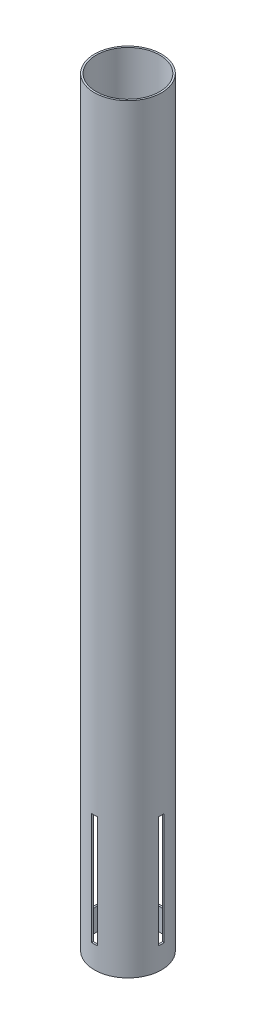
ISO-10303-21;
HEADER;
FILE_DESCRIPTION(('STEP AP214'),'2;1');
FILE_NAME('part.step','',(''),(''),'','','');
FILE_SCHEMA(('AUTOMOTIVE_DESIGN { 1 0 10303 214 1 1 1 1 }'));
ENDSEC;
DATA;
#1=APPLICATION_CONTEXT('core data for automotive mechanical design processes');
#2=APPLICATION_PROTOCOL_DEFINITION('international standard','automotive_design',2000,#1);
#3=PRODUCT_CONTEXT('',#1,'mechanical');
#4=PRODUCT('Part','Part','',(#3));
#5=PRODUCT_RELATED_PRODUCT_CATEGORY('part','',(#4));
#6=PRODUCT_DEFINITION_FORMATION('','',#4);
#7=PRODUCT_DEFINITION_CONTEXT('part definition',#1,'design');
#8=PRODUCT_DEFINITION('design','',#6,#7);
#9=PRODUCT_DEFINITION_SHAPE('','',#8);
#10=(LENGTH_UNIT() NAMED_UNIT(*) SI_UNIT(.MILLI.,.METRE.));
#11=(NAMED_UNIT(*) PLANE_ANGLE_UNIT() SI_UNIT($,.RADIAN.));
#12=(NAMED_UNIT(*) SI_UNIT($,.STERADIAN.) SOLID_ANGLE_UNIT());
#13=UNCERTAINTY_MEASURE_WITH_UNIT(LENGTH_MEASURE(1.E-05),#10,'distance_accuracy_value','');
#14=(GEOMETRIC_REPRESENTATION_CONTEXT(3) GLOBAL_UNCERTAINTY_ASSIGNED_CONTEXT((#13)) GLOBAL_UNIT_ASSIGNED_CONTEXT((#10,
#11,#12)) REPRESENTATION_CONTEXT('',''));
#15=CARTESIAN_POINT('',(0.,0.,0.));
#16=DIRECTION('',(0.,0.,1.));
#17=DIRECTION('',(1.,0.,0.));
#18=AXIS2_PLACEMENT_3D('',#15,#16,#17);
#19=CARTESIAN_POINT('',(0.,863.6,0.));
#20=DIRECTION('',(0.,-1.,0.));
#21=DIRECTION('',(0.,0.,-1.));
#22=AXIS2_PLACEMENT_3D('',#19,#20,#21);
#23=CYLINDRICAL_SURFACE('',#22,38.1);
#24=DIRECTION('',(0.,-1.,0.));
#25=VECTOR('',#24,1.);
#26=CARTESIAN_POINT('',(-37.9611314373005,863.6,-3.24999999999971));
#27=LINE('',#26,#25);
#28=CARTESIAN_POINT('',(-37.9611314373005,152.4,-3.24999999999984));
#29=VERTEX_POINT('',#28);
#30=CARTESIAN_POINT('',(-37.9611314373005,25.4,-3.24999999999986));
#31=VERTEX_POINT('',#30);
#32=EDGE_CURVE('E280',#29,#31,#27,.T.);
#33=ORIENTED_EDGE('',*,*,#32,.F.);
#34=CARTESIAN_POINT('',(0.,152.4,0.));
#35=DIRECTION('',(0.,-1.,0.));
#36=DIRECTION('',(0.,0.,-1.));
#37=AXIS2_PLACEMENT_3D('',#34,#35,#36);
#38=CIRCLE('',#37,38.1);
#39=CARTESIAN_POINT('',(-37.9611314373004,152.4,3.25000000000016));
#40=VERTEX_POINT('',#39);
#41=EDGE_CURVE('E287',#40,#29,#38,.T.);
#42=ORIENTED_EDGE('',*,*,#41,.F.);
#43=DIRECTION('',(0.,-1.,0.));
#44=VECTOR('',#43,1.);
#45=CARTESIAN_POINT('',(-37.9611314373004,863.6,3.25000000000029));
#46=LINE('',#45,#44);
#47=CARTESIAN_POINT('',(-37.9611314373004,25.4,3.25000000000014));
#48=VERTEX_POINT('',#47);
#49=EDGE_CURVE('E292',#48,#40,#46,.F.);
#50=ORIENTED_EDGE('',*,*,#49,.F.);
#51=CARTESIAN_POINT('',(0.,25.4,0.));
#52=DIRECTION('',(0.,1.,0.));
#53=DIRECTION('',(0.,0.,1.));
#54=AXIS2_PLACEMENT_3D('',#51,#52,#53);
#55=CIRCLE('',#54,38.1);
#56=EDGE_CURVE('E296',#31,#48,#55,.T.);
#57=ORIENTED_EDGE('',*,*,#56,.F.);
#58=EDGE_LOOP('',(#33,#42,#50,#57));
#59=FACE_BOUND('',#58,.T.);
#60=DIRECTION('',(0.,-1.,0.));
#61=VECTOR('',#60,1.);
#62=CARTESIAN_POINT('',(3.24999999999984,863.6,37.9611314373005));
#63=LINE('',#62,#61);
#64=CARTESIAN_POINT('',(3.24999999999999,25.4,37.9611314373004));
#65=VERTEX_POINT('',#64);
#66=CARTESIAN_POINT('',(3.24999999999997,152.4,37.9611314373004));
#67=VERTEX_POINT('',#66);
#68=EDGE_CURVE('E243',#65,#67,#63,.F.);
#69=ORIENTED_EDGE('',*,*,#68,.F.);
#70=CARTESIAN_POINT('',(0.,25.4,0.));
#71=DIRECTION('',(0.,1.,0.));
#72=DIRECTION('',(0.,0.,1.));
#73=AXIS2_PLACEMENT_3D('',#70,#71,#72);
#74=CIRCLE('',#73,38.1);
#75=CARTESIAN_POINT('',(-3.25,25.4,37.9611314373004));
#76=VERTEX_POINT('',#75);
#77=EDGE_CURVE('E258',#76,#65,#74,.T.);
#78=ORIENTED_EDGE('',*,*,#77,.F.);
#79=DIRECTION('',(0.,-1.,0.));
#80=VECTOR('',#79,1.);
#81=CARTESIAN_POINT('',(-3.25000000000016,863.6,37.9611314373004));
#82=LINE('',#81,#80);
#83=CARTESIAN_POINT('',(-3.25000000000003,152.4,37.9611314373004));
#84=VERTEX_POINT('',#83);
#85=EDGE_CURVE('E250',#84,#76,#82,.T.);
#86=ORIENTED_EDGE('',*,*,#85,.F.);
#87=CARTESIAN_POINT('',(0.,152.4,0.));
#88=DIRECTION('',(0.,-1.,0.));
#89=DIRECTION('',(0.,0.,-1.));
#90=AXIS2_PLACEMENT_3D('',#87,#88,#89);
#91=CIRCLE('',#90,38.1);
#92=EDGE_CURVE('E246',#67,#84,#91,.T.);
#93=ORIENTED_EDGE('',*,*,#92,.F.);
#94=EDGE_LOOP('',(#69,#78,#86,#93));
#95=FACE_BOUND('',#94,.T.);
#96=CARTESIAN_POINT('',(0.,863.6,0.));
#97=DIRECTION('',(0.,1.,0.));
#98=DIRECTION('',(0.,0.,1.));
#99=AXIS2_PLACEMENT_3D('',#96,#97,#98);
#100=CIRCLE('',#99,38.1);
#101=CARTESIAN_POINT('',(0.,863.6,38.1));
#102=VERTEX_POINT('',#101);
#103=EDGE_CURVE('E223',#102,#102,#100,.T.);
#104=ORIENTED_EDGE('',*,*,#103,.F.);
#105=EDGE_LOOP('',(#104));
#106=FACE_BOUND('',#105,.T.);
#107=CARTESIAN_POINT('',(0.,0.,0.));
#108=DIRECTION('',(0.,1.,0.));
#109=DIRECTION('',(0.,0.,1.));
#110=AXIS2_PLACEMENT_3D('',#107,#108,#109);
#111=CIRCLE('',#110,38.1);
#112=CARTESIAN_POINT('',(0.,0.,38.1));
#113=VERTEX_POINT('',#112);
#114=EDGE_CURVE('E224',#113,#113,#111,.T.);
#115=ORIENTED_EDGE('',*,*,#114,.T.);
#116=EDGE_LOOP('',(#115));
#117=FACE_BOUND('',#116,.T.);
#118=DIRECTION('',(0.,-1.,0.));
#119=VECTOR('',#118,1.);
#120=CARTESIAN_POINT('',(3.24999999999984,863.6,-37.9611314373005));
#121=LINE('',#120,#119);
#122=CARTESIAN_POINT('',(3.24999999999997,152.4,-37.9611314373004));
#123=VERTEX_POINT('',#122);
#124=CARTESIAN_POINT('',(3.24999999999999,25.4,-37.9611314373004));
#125=VERTEX_POINT('',#124);
#126=EDGE_CURVE('E236',#123,#125,#121,.T.);
#127=ORIENTED_EDGE('',*,*,#126,.F.);
#128=CARTESIAN_POINT('',(-3.25000000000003,152.4,-37.9611314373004));
#129=VERTEX_POINT('',#128);
#130=EDGE_CURVE('E247',#129,#123,#91,.T.);
#131=ORIENTED_EDGE('',*,*,#130,.F.);
#132=DIRECTION('',(0.,-1.,0.));
#133=VECTOR('',#132,1.);
#134=CARTESIAN_POINT('',(-3.25000000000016,863.6,-37.9611314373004));
#135=LINE('',#134,#133);
#136=CARTESIAN_POINT('',(-3.25,25.4,-37.9611314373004));
#137=VERTEX_POINT('',#136);
#138=EDGE_CURVE('E254',#137,#129,#135,.F.);
#139=ORIENTED_EDGE('',*,*,#138,.F.);
#140=EDGE_CURVE('E257',#125,#137,#74,.T.);
#141=ORIENTED_EDGE('',*,*,#140,.F.);
#142=EDGE_LOOP('',(#127,#131,#139,#141));
#143=FACE_BOUND('',#142,.T.);
#144=DIRECTION('',(0.,-1.,0.));
#145=VECTOR('',#144,1.);
#146=CARTESIAN_POINT('',(37.9611314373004,863.6,-3.24999999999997));
#147=LINE('',#146,#145);
#148=CARTESIAN_POINT('',(37.9611314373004,25.4,-3.25000000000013));
#149=VERTEX_POINT('',#148);
#150=CARTESIAN_POINT('',(37.9611314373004,152.4,-3.2500000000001));
#151=VERTEX_POINT('',#150);
#152=EDGE_CURVE('E283',#149,#151,#147,.F.);
#153=ORIENTED_EDGE('',*,*,#152,.F.);
#154=CARTESIAN_POINT('',(37.9611314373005,25.4,3.24999999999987));
#155=VERTEX_POINT('',#154);
#156=EDGE_CURVE('E295',#155,#149,#55,.T.);
#157=ORIENTED_EDGE('',*,*,#156,.F.);
#158=DIRECTION('',(0.,-1.,0.));
#159=VECTOR('',#158,1.);
#160=CARTESIAN_POINT('',(37.9611314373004,863.6,3.25000000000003));
#161=LINE('',#160,#159);
#162=CARTESIAN_POINT('',(37.9611314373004,152.4,3.24999999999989));
#163=VERTEX_POINT('',#162);
#164=EDGE_CURVE('E173',#163,#155,#161,.T.);
#165=ORIENTED_EDGE('',*,*,#164,.F.);
#166=EDGE_CURVE('E286',#151,#163,#38,.T.);
#167=ORIENTED_EDGE('',*,*,#166,.F.);
#168=EDGE_LOOP('',(#153,#157,#165,#167));
#169=FACE_BOUND('',#168,.T.);
#170=ADVANCED_FACE('F45',(#59,#95,#106,#117,#143,#169),#23,.T.);
#171=CARTESIAN_POINT('',(0.,863.6,0.));
#172=DIRECTION('',(0.,-1.,0.));
#173=DIRECTION('',(0.,0.,-1.));
#174=AXIS2_PLACEMENT_3D('',#171,#172,#173);
#175=CYLINDRICAL_SURFACE('',#174,36.1);
#176=CARTESIAN_POINT('',(0.,863.6,0.));
#177=DIRECTION('',(0.,1.,0.));
#178=DIRECTION('',(0.,0.,1.));
#179=AXIS2_PLACEMENT_3D('',#176,#177,#178);
#180=CIRCLE('',#179,36.1);
#181=CARTESIAN_POINT('',(0.,863.6,36.1));
#182=VERTEX_POINT('',#181);
#183=EDGE_CURVE('E228',#182,#182,#180,.T.);
#184=ORIENTED_EDGE('',*,*,#183,.T.);
#185=EDGE_LOOP('',(#184));
#186=FACE_BOUND('',#185,.T.);
#187=CARTESIAN_POINT('',(0.,0.,0.));
#188=DIRECTION('',(0.,1.,0.));
#189=DIRECTION('',(0.,0.,1.));
#190=AXIS2_PLACEMENT_3D('',#187,#188,#189);
#191=CIRCLE('',#190,36.1);
#192=CARTESIAN_POINT('',(0.,0.,36.1));
#193=VERTEX_POINT('',#192);
#194=EDGE_CURVE('E232',#193,#193,#191,.T.);
#195=ORIENTED_EDGE('',*,*,#194,.F.);
#196=EDGE_LOOP('',(#195));
#197=FACE_BOUND('',#196,.T.);
#198=CARTESIAN_POINT('',(0.,25.4,0.));
#199=DIRECTION('',(0.,1.,0.));
#200=DIRECTION('',(0.,0.,1.));
#201=AXIS2_PLACEMENT_3D('',#198,#199,#200);
#202=CIRCLE('',#201,36.1);
#203=CARTESIAN_POINT('',(-3.25,25.4,35.9534073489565));
#204=VERTEX_POINT('',#203);
#205=CARTESIAN_POINT('',(3.24999999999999,25.4,35.9534073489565));
#206=VERTEX_POINT('',#205);
#207=EDGE_CURVE('E219',#204,#206,#202,.T.);
#208=ORIENTED_EDGE('',*,*,#207,.T.);
#209=DIRECTION('',(0.,-1.,0.));
#210=VECTOR('',#209,1.);
#211=CARTESIAN_POINT('',(3.24999999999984,863.6,35.9534073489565));
#212=LINE('',#211,#210);
#213=CARTESIAN_POINT('',(3.24999999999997,152.4,35.9534073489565));
#214=VERTEX_POINT('',#213);
#215=EDGE_CURVE('E207',#206,#214,#212,.F.);
#216=ORIENTED_EDGE('',*,*,#215,.T.);
#217=CARTESIAN_POINT('',(0.,152.4,0.));
#218=DIRECTION('',(0.,-1.,0.));
#219=DIRECTION('',(0.,0.,-1.));
#220=AXIS2_PLACEMENT_3D('',#217,#218,#219);
#221=CIRCLE('',#220,36.1);
#222=CARTESIAN_POINT('',(-3.25000000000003,152.4,35.9534073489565));
#223=VERTEX_POINT('',#222);
#224=EDGE_CURVE('E211',#214,#223,#221,.T.);
#225=ORIENTED_EDGE('',*,*,#224,.T.);
#226=DIRECTION('',(0.,-1.,0.));
#227=VECTOR('',#226,1.);
#228=CARTESIAN_POINT('',(-3.25000000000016,863.6,35.9534073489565));
#229=LINE('',#228,#227);
#230=EDGE_CURVE('E215',#223,#204,#229,.T.);
#231=ORIENTED_EDGE('',*,*,#230,.T.);
#232=EDGE_LOOP('',(#208,#216,#225,#231));
#233=FACE_BOUND('',#232,.T.);
#234=CARTESIAN_POINT('',(-3.25000000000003,152.4,-35.9534073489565));
#235=VERTEX_POINT('',#234);
#236=CARTESIAN_POINT('',(3.24999999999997,152.4,-35.9534073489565));
#237=VERTEX_POINT('',#236);
#238=EDGE_CURVE('E201',#235,#237,#221,.T.);
#239=ORIENTED_EDGE('',*,*,#238,.T.);
#240=DIRECTION('',(0.,-1.,0.));
#241=VECTOR('',#240,1.);
#242=CARTESIAN_POINT('',(3.24999999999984,863.6,-35.9534073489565));
#243=LINE('',#242,#241);
#244=CARTESIAN_POINT('',(3.24999999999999,25.4,-35.9534073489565));
#245=VERTEX_POINT('',#244);
#246=EDGE_CURVE('E197',#237,#245,#243,.T.);
#247=ORIENTED_EDGE('',*,*,#246,.T.);
#248=CARTESIAN_POINT('',(-3.25,25.4,-35.9534073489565));
#249=VERTEX_POINT('',#248);
#250=EDGE_CURVE('E206',#245,#249,#202,.T.);
#251=ORIENTED_EDGE('',*,*,#250,.T.);
#252=DIRECTION('',(0.,-1.,0.));
#253=VECTOR('',#252,1.);
#254=CARTESIAN_POINT('',(-3.25000000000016,863.6,-35.9534073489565));
#255=LINE('',#254,#253);
#256=EDGE_CURVE('E202',#249,#235,#255,.F.);
#257=ORIENTED_EDGE('',*,*,#256,.T.);
#258=EDGE_LOOP('',(#239,#247,#251,#257));
#259=FACE_BOUND('',#258,.T.);
#260=CARTESIAN_POINT('',(0.,152.4,0.));
#261=DIRECTION('',(0.,-1.,0.));
#262=DIRECTION('',(0.,0.,-1.));
#263=AXIS2_PLACEMENT_3D('',#260,#261,#262);
#264=CIRCLE('',#263,36.1);
#265=CARTESIAN_POINT('',(-35.9534073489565,152.4,3.25000000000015));
#266=VERTEX_POINT('',#265);
#267=CARTESIAN_POINT('',(-35.9534073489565,152.4,-3.24999999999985));
#268=VERTEX_POINT('',#267);
#269=EDGE_CURVE('E184',#266,#268,#264,.T.);
#270=ORIENTED_EDGE('',*,*,#269,.T.);
#271=DIRECTION('',(0.,-1.,0.));
#272=VECTOR('',#271,1.);
#273=CARTESIAN_POINT('',(-35.9534073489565,863.6,-3.24999999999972));
#274=LINE('',#273,#272);
#275=CARTESIAN_POINT('',(-35.9534073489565,25.4,-3.24999999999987));
#276=VERTEX_POINT('',#275);
#277=EDGE_CURVE('E165',#268,#276,#274,.T.);
#278=ORIENTED_EDGE('',*,*,#277,.T.);
#279=CARTESIAN_POINT('',(0.,25.4,0.));
#280=DIRECTION('',(0.,1.,0.));
#281=DIRECTION('',(0.,0.,1.));
#282=AXIS2_PLACEMENT_3D('',#279,#280,#281);
#283=CIRCLE('',#282,36.1);
#284=CARTESIAN_POINT('',(-35.9534073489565,25.4,3.25000000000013));
#285=VERTEX_POINT('',#284);
#286=EDGE_CURVE('E167',#276,#285,#283,.T.);
#287=ORIENTED_EDGE('',*,*,#286,.T.);
#288=DIRECTION('',(0.,-1.,0.));
#289=VECTOR('',#288,1.);
#290=CARTESIAN_POINT('',(-35.9534073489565,863.6,3.25000000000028));
#291=LINE('',#290,#289);
#292=EDGE_CURVE('E191',#285,#266,#291,.F.);
#293=ORIENTED_EDGE('',*,*,#292,.T.);
#294=EDGE_LOOP('',(#270,#278,#287,#293));
#295=FACE_BOUND('',#294,.T.);
#296=CARTESIAN_POINT('',(35.9534073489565,25.4,3.24999999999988));
#297=VERTEX_POINT('',#296);
#298=CARTESIAN_POINT('',(35.9534073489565,25.4,-3.25000000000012));
#299=VERTEX_POINT('',#298);
#300=EDGE_CURVE('E156',#297,#299,#283,.T.);
#301=ORIENTED_EDGE('',*,*,#300,.T.);
#302=DIRECTION('',(0.,-1.,0.));
#303=VECTOR('',#302,1.);
#304=CARTESIAN_POINT('',(35.9534073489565,863.6,-3.24999999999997));
#305=LINE('',#304,#303);
#306=CARTESIAN_POINT('',(35.9534073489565,152.4,-3.2500000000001));
#307=VERTEX_POINT('',#306);
#308=EDGE_CURVE('E11',#299,#307,#305,.F.);
#309=ORIENTED_EDGE('',*,*,#308,.T.);
#310=CARTESIAN_POINT('',(35.9534073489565,152.4,3.2499999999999));
#311=VERTEX_POINT('',#310);
#312=EDGE_CURVE('E53',#307,#311,#264,.T.);
#313=ORIENTED_EDGE('',*,*,#312,.T.);
#314=DIRECTION('',(0.,-1.,0.));
#315=VECTOR('',#314,1.);
#316=CARTESIAN_POINT('',(35.9534073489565,863.6,3.25000000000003));
#317=LINE('',#316,#315);
#318=EDGE_CURVE('E164',#311,#297,#317,.T.);
#319=ORIENTED_EDGE('',*,*,#318,.T.);
#320=EDGE_LOOP('',(#301,#309,#313,#319));
#321=FACE_BOUND('',#320,.T.);
#322=ADVANCED_FACE('F180',(#186,#197,#233,#259,#295,#321),#175,.F.);
#323=CARTESIAN_POINT('',(0.,863.6,0.));
#324=DIRECTION('',(0.,1.,0.));
#325=DIRECTION('',(0.,0.,1.));
#326=AXIS2_PLACEMENT_3D('',#323,#324,#325);
#327=PLANE('',#326);
#328=ORIENTED_EDGE('',*,*,#183,.F.);
#329=EDGE_LOOP('',(#328));
#330=FACE_BOUND('',#329,.T.);
#331=ORIENTED_EDGE('',*,*,#103,.T.);
#332=EDGE_LOOP('',(#331));
#333=FACE_BOUND('',#332,.T.);
#334=ADVANCED_FACE('F371',(#330,#333),#327,.T.);
#335=CARTESIAN_POINT('',(0.,0.,0.));
#336=DIRECTION('',(0.,1.,0.));
#337=DIRECTION('',(0.,0.,1.));
#338=AXIS2_PLACEMENT_3D('',#335,#336,#337);
#339=PLANE('',#338);
#340=ORIENTED_EDGE('',*,*,#194,.T.);
#341=EDGE_LOOP('',(#340));
#342=FACE_BOUND('',#341,.T.);
#343=ORIENTED_EDGE('',*,*,#114,.F.);
#344=EDGE_LOOP('',(#343));
#345=FACE_BOUND('',#344,.T.);
#346=ADVANCED_FACE('F365',(#342,#345),#339,.F.);
#347=CARTESIAN_POINT('',(-3.25,25.4,863.6));
#348=DIRECTION('',(0.,1.,0.));
#349=DIRECTION('',(0.,0.,1.));
#350=AXIS2_PLACEMENT_3D('',#347,#348,#349);
#351=PLANE('',#350);
#352=ORIENTED_EDGE('',*,*,#77,.T.);
#353=DIRECTION('',(0.,0.,-1.));
#354=VECTOR('',#353,1.);
#355=CARTESIAN_POINT('',(3.25,25.4,863.6));
#356=LINE('',#355,#354);
#357=EDGE_CURVE('E276',#65,#206,#356,.T.);
#358=ORIENTED_EDGE('',*,*,#357,.T.);
#359=ORIENTED_EDGE('',*,*,#207,.F.);
#360=DIRECTION('',(0.,0.,-1.));
#361=VECTOR('',#360,1.);
#362=CARTESIAN_POINT('',(-3.25,25.4,863.6));
#363=LINE('',#362,#361);
#364=EDGE_CURVE('E271',#76,#204,#363,.T.);
#365=ORIENTED_EDGE('',*,*,#364,.F.);
#366=EDGE_LOOP('',(#352,#358,#359,#365));
#367=FACE_BOUND('',#366,.T.);
#368=ADVANCED_FACE('F353',(#367),#351,.T.);
#369=CARTESIAN_POINT('',(-3.25,25.4,863.6));
#370=DIRECTION('',(1.,0.,0.));
#371=DIRECTION('',(0.,1.,0.));
#372=AXIS2_PLACEMENT_3D('',#369,#370,#371);
#373=PLANE('',#372);
#374=ORIENTED_EDGE('',*,*,#85,.T.);
#375=ORIENTED_EDGE('',*,*,#364,.T.);
#376=ORIENTED_EDGE('',*,*,#230,.F.);
#377=DIRECTION('',(0.,0.,-1.));
#378=VECTOR('',#377,1.);
#379=CARTESIAN_POINT('',(-3.25000000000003,152.4,863.6));
#380=LINE('',#379,#378);
#381=EDGE_CURVE('E266',#84,#223,#380,.T.);
#382=ORIENTED_EDGE('',*,*,#381,.F.);
#383=EDGE_LOOP('',(#374,#375,#376,#382));
#384=FACE_BOUND('',#383,.T.);
#385=ADVANCED_FACE('F362',(#384),#373,.T.);
#386=CARTESIAN_POINT('',(-3.25000000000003,152.4,863.6));
#387=DIRECTION('',(0.,-1.,0.));
#388=DIRECTION('',(0.,0.,-1.));
#389=AXIS2_PLACEMENT_3D('',#386,#387,#388);
#390=PLANE('',#389);
#391=ORIENTED_EDGE('',*,*,#92,.T.);
#392=ORIENTED_EDGE('',*,*,#381,.T.);
#393=ORIENTED_EDGE('',*,*,#224,.F.);
#394=DIRECTION('',(0.,0.,-1.));
#395=VECTOR('',#394,1.);
#396=CARTESIAN_POINT('',(3.24999999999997,152.4,863.6));
#397=LINE('',#396,#395);
#398=EDGE_CURVE('E261',#67,#214,#397,.T.);
#399=ORIENTED_EDGE('',*,*,#398,.F.);
#400=EDGE_LOOP('',(#391,#392,#393,#399));
#401=FACE_BOUND('',#400,.T.);
#402=ADVANCED_FACE('F397',(#401),#390,.T.);
#403=CARTESIAN_POINT('',(3.25,25.4,863.6));
#404=DIRECTION('',(-1.,0.,0.));
#405=DIRECTION('',(0.,-1.,0.));
#406=AXIS2_PLACEMENT_3D('',#403,#404,#405);
#407=PLANE('',#406);
#408=ORIENTED_EDGE('',*,*,#68,.T.);
#409=ORIENTED_EDGE('',*,*,#398,.T.);
#410=ORIENTED_EDGE('',*,*,#215,.F.);
#411=ORIENTED_EDGE('',*,*,#357,.F.);
#412=EDGE_LOOP('',(#408,#409,#410,#411));
#413=FACE_BOUND('',#412,.T.);
#414=ADVANCED_FACE('F396',(#413),#407,.T.);
#415=ORIENTED_EDGE('',*,*,#126,.T.);
#416=EDGE_CURVE('E277',#245,#125,#356,.T.);
#417=ORIENTED_EDGE('',*,*,#416,.F.);
#418=ORIENTED_EDGE('',*,*,#246,.F.);
#419=EDGE_CURVE('E262',#237,#123,#397,.T.);
#420=ORIENTED_EDGE('',*,*,#419,.T.);
#421=EDGE_LOOP('',(#415,#417,#418,#420));
#422=FACE_BOUND('',#421,.T.);
#423=ADVANCED_FACE('F346',(#422),#407,.T.);
#424=ORIENTED_EDGE('',*,*,#130,.T.);
#425=ORIENTED_EDGE('',*,*,#419,.F.);
#426=ORIENTED_EDGE('',*,*,#238,.F.);
#427=EDGE_CURVE('E267',#235,#129,#380,.T.);
#428=ORIENTED_EDGE('',*,*,#427,.T.);
#429=EDGE_LOOP('',(#424,#425,#426,#428));
#430=FACE_BOUND('',#429,.T.);
#431=ADVANCED_FACE('F336',(#430),#390,.T.);
#432=ORIENTED_EDGE('',*,*,#138,.T.);
#433=ORIENTED_EDGE('',*,*,#427,.F.);
#434=ORIENTED_EDGE('',*,*,#256,.F.);
#435=EDGE_CURVE('E272',#249,#137,#363,.T.);
#436=ORIENTED_EDGE('',*,*,#435,.T.);
#437=EDGE_LOOP('',(#432,#433,#434,#436));
#438=FACE_BOUND('',#437,.T.);
#439=ADVANCED_FACE('F339',(#438),#373,.T.);
#440=ORIENTED_EDGE('',*,*,#140,.T.);
#441=ORIENTED_EDGE('',*,*,#435,.F.);
#442=ORIENTED_EDGE('',*,*,#250,.F.);
#443=ORIENTED_EDGE('',*,*,#416,.T.);
#444=EDGE_LOOP('',(#440,#441,#442,#443));
#445=FACE_BOUND('',#444,.T.);
#446=ADVANCED_FACE('F349',(#445),#351,.T.);
#447=CARTESIAN_POINT('',(863.6,25.4,3.24999999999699));
#448=DIRECTION('',(0.,1.,0.));
#449=DIRECTION('',(0.,0.,1.));
#450=AXIS2_PLACEMENT_3D('',#447,#448,#449);
#451=PLANE('',#450);
#452=ORIENTED_EDGE('',*,*,#56,.T.);
#453=DIRECTION('',(-1.,0.,0.));
#454=VECTOR('',#453,1.);
#455=CARTESIAN_POINT('',(863.6,25.4,3.24999999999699));
#456=LINE('',#455,#454);
#457=EDGE_CURVE('E177',#285,#48,#456,.T.);
#458=ORIENTED_EDGE('',*,*,#457,.F.);
#459=ORIENTED_EDGE('',*,*,#286,.F.);
#460=DIRECTION('',(-1.,0.,0.));
#461=VECTOR('',#460,1.);
#462=CARTESIAN_POINT('',(863.6,25.4,-3.25000000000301));
#463=LINE('',#462,#461);
#464=EDGE_CURVE('E68',#276,#31,#463,.T.);
#465=ORIENTED_EDGE('',*,*,#464,.T.);
#466=EDGE_LOOP('',(#452,#458,#459,#465));
#467=FACE_BOUND('',#466,.T.);
#468=ADVANCED_FACE('F351',(#467),#451,.T.);
#469=CARTESIAN_POINT('',(863.6,25.4,3.24999999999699));
#470=DIRECTION('',(0.,0.,-1.));
#471=DIRECTION('',(-1.,0.,0.));
#472=AXIS2_PLACEMENT_3D('',#469,#470,#471);
#473=PLANE('',#472);
#474=ORIENTED_EDGE('',*,*,#49,.T.);
#475=DIRECTION('',(-1.,0.,0.));
#476=VECTOR('',#475,1.);
#477=CARTESIAN_POINT('',(863.6,152.4,3.24999999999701));
#478=LINE('',#477,#476);
#479=EDGE_CURVE('E176',#266,#40,#478,.T.);
#480=ORIENTED_EDGE('',*,*,#479,.F.);
#481=ORIENTED_EDGE('',*,*,#292,.F.);
#482=ORIENTED_EDGE('',*,*,#457,.T.);
#483=EDGE_LOOP('',(#474,#480,#481,#482));
#484=FACE_BOUND('',#483,.T.);
#485=ADVANCED_FACE('F359',(#484),#473,.T.);
#486=CARTESIAN_POINT('',(863.6,152.4,3.24999999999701));
#487=DIRECTION('',(0.,-1.,0.));
#488=DIRECTION('',(0.,0.,-1.));
#489=AXIS2_PLACEMENT_3D('',#486,#487,#488);
#490=PLANE('',#489);
#491=ORIENTED_EDGE('',*,*,#41,.T.);
#492=DIRECTION('',(-1.,0.,0.));
#493=VECTOR('',#492,1.);
#494=CARTESIAN_POINT('',(863.6,152.4,-3.25000000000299));
#495=LINE('',#494,#493);
#496=EDGE_CURVE('E300',#268,#29,#495,.T.);
#497=ORIENTED_EDGE('',*,*,#496,.F.);
#498=ORIENTED_EDGE('',*,*,#269,.F.);
#499=ORIENTED_EDGE('',*,*,#479,.T.);
#500=EDGE_LOOP('',(#491,#497,#498,#499));
#501=FACE_BOUND('',#500,.T.);
#502=ADVANCED_FACE('F462',(#501),#490,.T.);
#503=CARTESIAN_POINT('',(863.6,25.4,-3.25000000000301));
#504=DIRECTION('',(0.,0.,1.));
#505=DIRECTION('',(1.,0.,0.));
#506=AXIS2_PLACEMENT_3D('',#503,#504,#505);
#507=PLANE('',#506);
#508=ORIENTED_EDGE('',*,*,#32,.T.);
#509=ORIENTED_EDGE('',*,*,#464,.F.);
#510=ORIENTED_EDGE('',*,*,#277,.F.);
#511=ORIENTED_EDGE('',*,*,#496,.T.);
#512=EDGE_LOOP('',(#508,#509,#510,#511));
#513=FACE_BOUND('',#512,.T.);
#514=ADVANCED_FACE('F472',(#513),#507,.T.);
#515=ORIENTED_EDGE('',*,*,#152,.T.);
#516=EDGE_CURVE('E299',#151,#307,#495,.T.);
#517=ORIENTED_EDGE('',*,*,#516,.T.);
#518=ORIENTED_EDGE('',*,*,#308,.F.);
#519=EDGE_CURVE('E159',#149,#299,#463,.T.);
#520=ORIENTED_EDGE('',*,*,#519,.F.);
#521=EDGE_LOOP('',(#515,#517,#518,#520));
#522=FACE_BOUND('',#521,.T.);
#523=ADVANCED_FACE('F483',(#522),#507,.T.);
#524=ORIENTED_EDGE('',*,*,#166,.T.);
#525=EDGE_CURVE('E304',#163,#311,#478,.T.);
#526=ORIENTED_EDGE('',*,*,#525,.T.);
#527=ORIENTED_EDGE('',*,*,#312,.F.);
#528=ORIENTED_EDGE('',*,*,#516,.F.);
#529=EDGE_LOOP('',(#524,#526,#527,#528));
#530=FACE_BOUND('',#529,.T.);
#531=ADVANCED_FACE('F475',(#530),#490,.T.);
#532=ORIENTED_EDGE('',*,*,#164,.T.);
#533=EDGE_CURVE('E60',#155,#297,#456,.T.);
#534=ORIENTED_EDGE('',*,*,#533,.T.);
#535=ORIENTED_EDGE('',*,*,#318,.F.);
#536=ORIENTED_EDGE('',*,*,#525,.F.);
#537=EDGE_LOOP('',(#532,#534,#535,#536));
#538=FACE_BOUND('',#537,.T.);
#539=ADVANCED_FACE('F169',(#538),#473,.T.);
#540=ORIENTED_EDGE('',*,*,#156,.T.);
#541=ORIENTED_EDGE('',*,*,#519,.T.);
#542=ORIENTED_EDGE('',*,*,#300,.F.);
#543=ORIENTED_EDGE('',*,*,#533,.F.);
#544=EDGE_LOOP('',(#540,#541,#542,#543));
#545=FACE_BOUND('',#544,.T.);
#546=ADVANCED_FACE('F157',(#545),#451,.T.);
#547=CLOSED_SHELL('',(#170,#322,#334,#346,#368,#385,#402,#414,#423,#431,#439,#446,#468,#485,
#502,#514,#523,#531,#539,#546));
#548=MANIFOLD_SOLID_BREP('B2',#547);
#549=ADVANCED_BREP_SHAPE_REPRESENTATION('',(#18,#548),#14);
#550=SHAPE_DEFINITION_REPRESENTATION(#9,#549);
ENDSEC;
END-ISO-10303-21;
